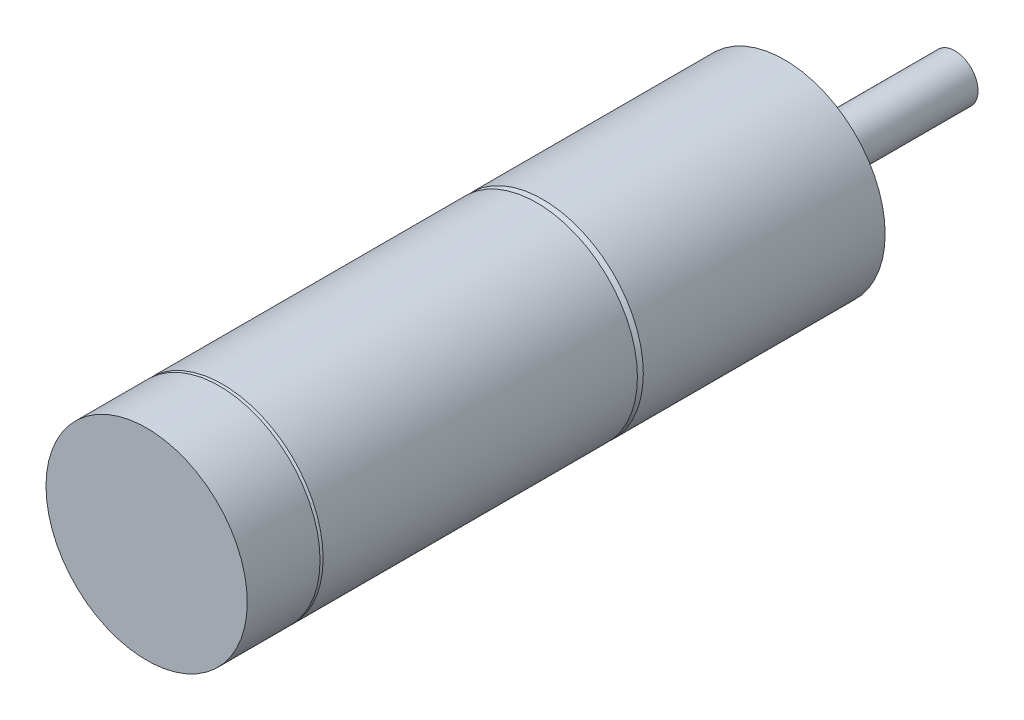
from build123d import *

# Parameters (mm, degrees)
SKETCH1_R         = 6.5
EXTRUDE1_DEPTH    = 16
CHAMFER1_SIZE     = 0.381
SKETCH2_R         = 6.5
EXTRUDE2_DEPTH    = 20.5
SKETCH3_R         = 3
EXTRUDE3_DEPTH    = 1
SKETCH9_R         = 2.5
EXTRUDE6_DEPTH    = 1.6
SKETCH5_R         = 1.5
EXTRUDE4_DEPTH    = 11
CHAMFER2_SIZE     = 0.2
SKETCH6_R         = 6.5
EXTRUDE5_DEPTH    = 4.7
CIRPATTERN1_COUNT = 2


with BuildPart() as part:
    # Sketch1 → Extrude1 (new body)
    with BuildSketch(Plane.XY):
        Circle(SKETCH1_R)
    extrude(amount=EXTRUDE1_DEPTH)

    # Chamfer1
    chamfer1_edges = [part.edges().sort_by_distance(p)[0] for p in [
        (-6.5, 0, 16),
    ]]
    chamfer(chamfer1_edges, length=CHAMFER1_SIZE)

    # Sketch2 → Extrude2 (add)
    with BuildSketch(Plane.XY.offset(16)):
        Circle(SKETCH2_R)
    extrude(amount=EXTRUDE2_DEPTH)

    # Sketch3 → Extrude3 (add)
    with BuildSketch(Plane(origin=(0, 0, 0), x_dir=(-1, 0, 0), z_dir=(0, 0, -1))):
        with Locations(Location((0, 0, 0), (0, 0, 180))):
            Circle(SKETCH3_R)
    extrude(amount=EXTRUDE3_DEPTH)

    # Sketch9 → Extrude6 (add)
    with BuildSketch(Plane(origin=(0, 0, -1), x_dir=(-1, 0, 0), z_dir=(0, 0, -1))):
        Circle(SKETCH9_R)
    extrude(amount=EXTRUDE6_DEPTH)

    # Sketch5 → Extrude4 (add)
    with BuildSketch(Plane(origin=(0, 0, 0), x_dir=(-1, 0, 0), z_dir=(0, 0, -1))):
        Circle(SKETCH5_R)
    extrude(amount=EXTRUDE4_DEPTH)

    # Chamfer2
    chamfer2_edges = [part.edges().sort_by_distance(p)[0] for p in [
        (-6.5, 0, 36.5),
    ]]
    chamfer(chamfer2_edges, length=CHAMFER2_SIZE)

    # Sketch6 → Extrude5 (add)
    with BuildSketch(Plane.XY.offset(36.5)):
        Circle(SKETCH6_R)
    extrude(amount=EXTRUDE5_DEPTH)

    # Sketch10 → M2x0.4 Tapped Hole1 (revolve, cut)
    with BuildSketch(Plane(origin=(-3.686980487, -2.994774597, 0), x_dir=(0, 1, 0), z_dir=(1, 0, 0))):
        Polygon((0, 0), (0, 5.480688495), (0.8, 5), (0.8, 4), (1, 4), (1, 0), align=None)
    m2x0_4_tapped_hole1 = revolve(axis=Axis((-3.686980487, -2.994774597, -6.35), (0, 0, 1)), mode=Mode.SUBTRACT)

    # CirPattern1: M2x0.4 Tapped Hole1 ×2 about axis
    cirpattern1_axis = Axis((0, 0, 0), (0, 0, 1))
    for i in range(1, CIRPATTERN1_COUNT):
        add(m2x0_4_tapped_hole1.rotate(cirpattern1_axis, i * 360 / CIRPATTERN1_COUNT), mode=Mode.SUBTRACT)


solid = part.part
